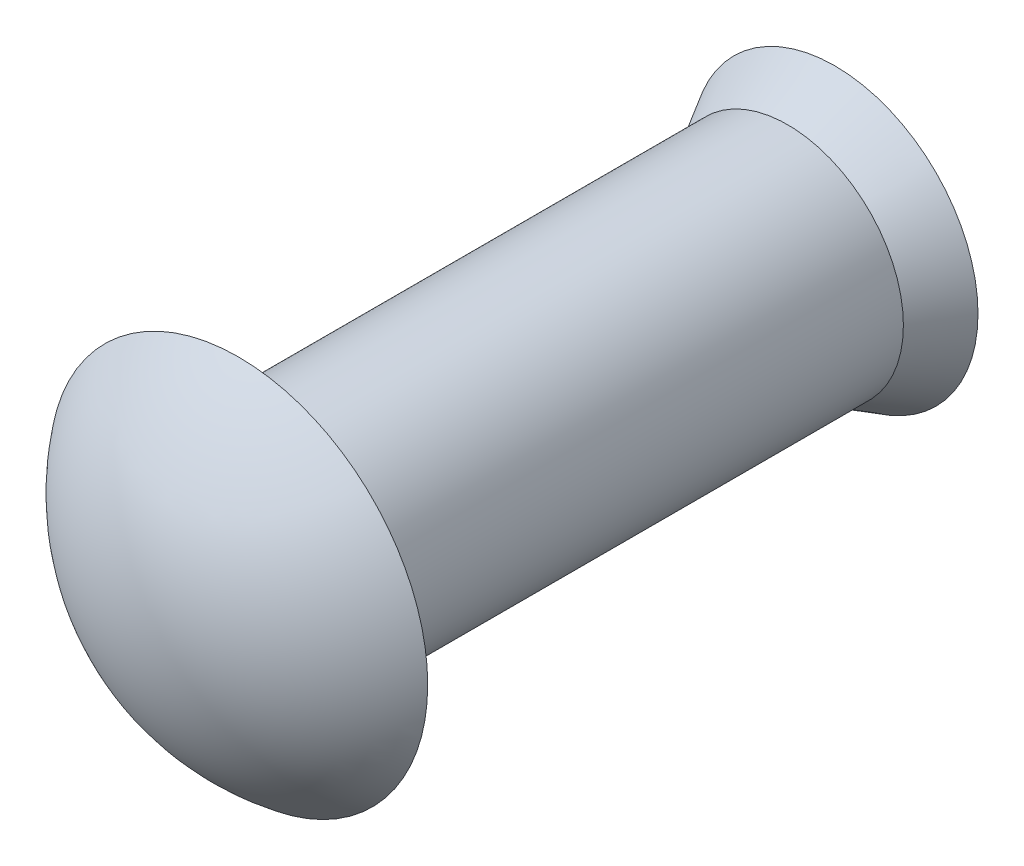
from build123d import *


with BuildPart() as part:
    # Sketch 1 → Revolve 1 (revolve)
    with BuildSketch(Plane(origin=(0, 0, 0), x_dir=(0, 0, -1), z_dir=(1, 0, 0)), mode=Mode.PRIVATE) as revolve_1_sk:
        with BuildLine():
            Line((1.5875, 3.175), (1.5875, 1.9431))
            Line((1.5875, 1.9431), (10.80262, 1.9431))
            Line((10.80262, 1.9431), (11.59637, 2.401371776))
            Line((11.59637, 2.401371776), (11.59637, 0))
            Line((11.59637, 0), (0, 0))
            ThreePointArc((0, 0), (0.418992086, 1.774878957), (1.5875, 3.175))
        make_face()
    revolve(revolve_1_sk.sketch.rotate(Axis((0, 0, 0), (0, 0, -1)), 90), axis=Axis((0, 0, 0), (0, 0, -1)))


solid = part.part
